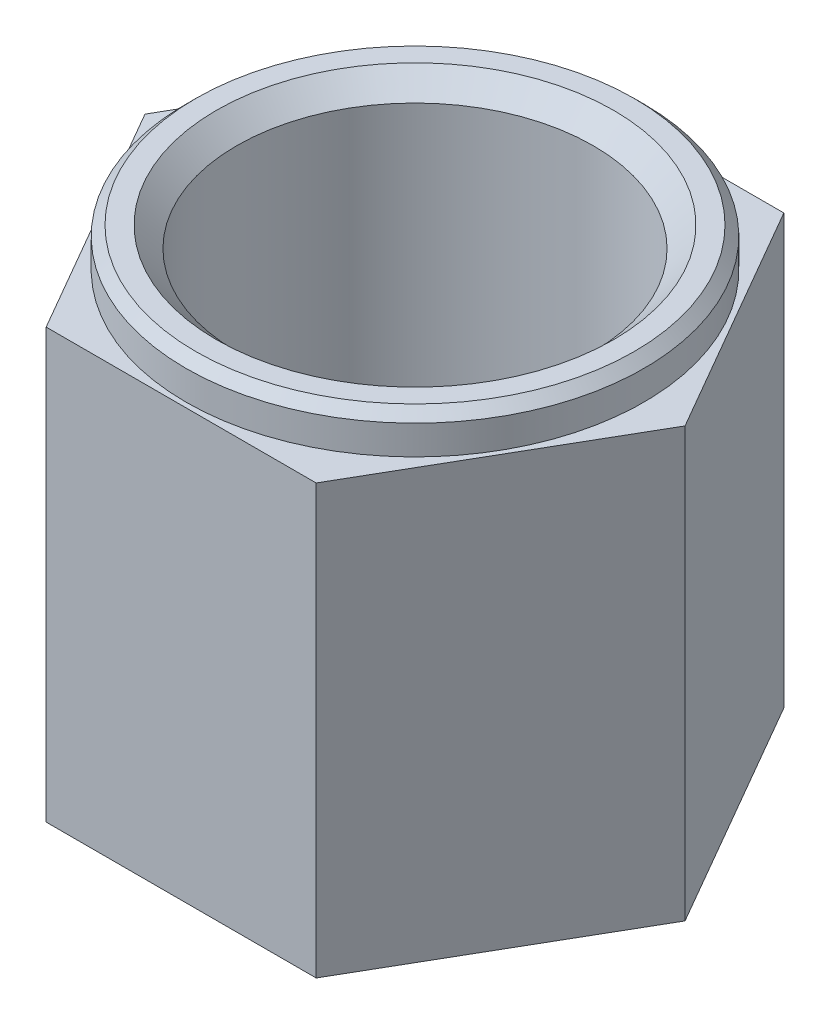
from build123d import *

# Parameters (mm, degrees)
P_IDAT_VYSUNUT_M1_DEPTH = 24
SKICA3_W                = 5
SKICA3_H                = 2
ZKOSEN_1_SIZE           = 0.5


with BuildPart() as part:
    # Skica1 → P_idat vysunut_m1 (new body)
    with BuildSketch(Plane(origin=(0, 0, 0), x_dir=(1, 0, 0), z_dir=(0, 1, 0))):
        Polygon((13.856406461, 0), (6.92820323, 12), (-6.92820323, 12), (-13.856406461, 0), (-6.92820323, -12), (6.92820323, -12), align=None)
    extrude(amount=P_IDAT_VYSUNUT_M1_DEPTH)

    # Skica2 → Odebrat rotac_1 (revolve, cut)
    with BuildSketch(Plane(origin=(0, 0, 0), x_dir=(0, 0, -1), z_dir=(1, 0, 0))):
        with BuildLine():
            Line((0, 0), (-7, 0))
            Line((-7, 0), (-7, 3.5))
            Line((-7, 3.5), (-7.5, 4))
            Line((-7.5, 4), (-9.6, 4))
            ThreePointArc((-9.6, 4), (-9.953553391, 4.146446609), (-10.1, 4.5))
            Line((-10.1, 4.5), (-10.1, 7.8))
            ThreePointArc((-10.1, 7.8), (-10.07371797, 7.959972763), (-9.997634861, 8.10312789))
            Line((-9.997634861, 8.10312789), (-9.147634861, 8.95312789))
            Line((-9.147634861, 8.95312789), (-9.147634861, 22.95312789))
            Line((-9.147634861, 22.95312789), (-10.194506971, 24))
            Line((-10.194506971, 24), (0, 24))
            Line((0, 24), (0, 0))
        make_face()
    revolve(axis=Axis((0, 24, 0), (0, -1, 0)), mode=Mode.SUBTRACT)

    # Skica3 → Odebrat rotac_3 (revolve, cut)
    with BuildSketch(Plane(origin=(0, 0, 0), x_dir=(0, 0, -1), z_dir=(1, 0, 0))):
        with Locations((-14.25, 23)):
            Rectangle(SKICA3_W, SKICA3_H)
    revolve(axis=Axis((0, 24, 0), (0, -1, 0)), mode=Mode.SUBTRACT)

    # Zkosen_1
    zkosen_1_edges = [part.edges().sort_by_distance(p)[0] for p in [
        (0, 24, -11.75),
    ]]
    chamfer(zkosen_1_edges, length=ZKOSEN_1_SIZE)


solid = part.part
